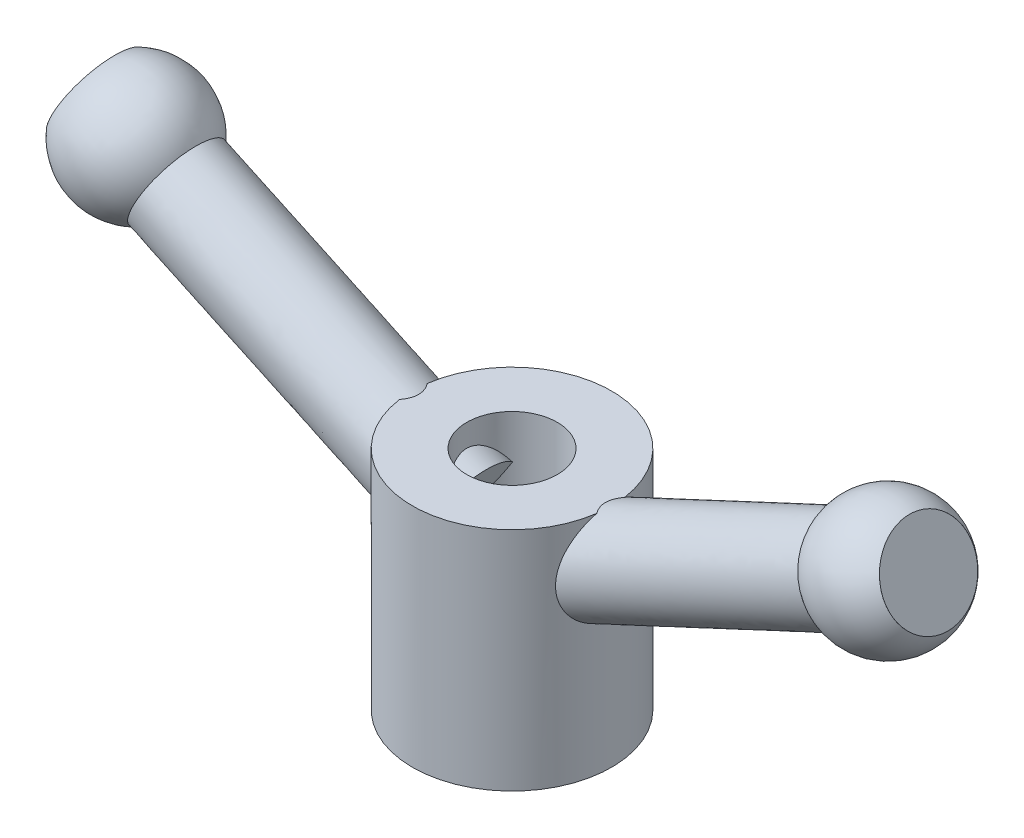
from build123d import *

# Parameters (mm, degrees)
SKETCH1_R      = 17.4625
SKETCH1_R_2    = 7.9375
EXTRUDE1_DEPTH = 39.6875
SKETCH4_R      = 7.9375
SKETCH6_R      = 7.9375


with BuildPart() as part:
    # Sketch1 → Extrude1 (new body)
    with BuildSketch(Plane(origin=(0, 0, 0), x_dir=(1, 0, 0), z_dir=(0, 1, 0))):
        with Locations(Location((0, 0, 0), (0, 0, 172.002086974))):
            Circle(SKETCH1_R)
        with Locations(Location((0, 0, 0), (0, 0, 270))):
            Circle(SKETCH1_R_2, mode=Mode.SUBTRACT)
    extrude(amount=EXTRUDE1_DEPTH)

    # Sweep1: sweep along a path in Sketch2
    with BuildLine(Plane.XY) as sweep1_path:
        Line((-7.9375, 26.9875), (-73.025, 57.3382997))
    # Sketch4 → Sweep1 (sweep)
    with BuildSketch(Plane(origin=(-16.89176645, 7.941461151, 0), x_dir=(0, 0, -1), z_dir=(0.9049756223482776, -0.4254634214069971, 0))):
        with Locations((0, 21.045913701)):
            Circle(SKETCH4_R)
    sweep(path=sweep1_path.line)

    # Sweep2: sweep along a path in Sketch2_3
    with BuildLine(Plane.XY) as sweep2_path:
        Line((7.9375, 26.9875), (73.025, 57.3382997))
    # Sketch6 → Sweep2 (sweep)
    with BuildSketch(Plane(origin=(16.89176645, 7.941461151, 0), x_dir=(0, 0, -1), z_dir=(0.9049756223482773, 0.4254634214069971, 0))):
        with Locations((0, 21.045913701)):
            Circle(SKETCH6_R)
    sweep(path=sweep2_path.line)


with BuildPart() as body_2:
    # Sketch7 → Revolve1 (revolve)
    with BuildSketch(Plane(origin=(-8.91912553, 19.127126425, 0), x_dir=(-0.9063069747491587, -0.42261788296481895, 0.0013388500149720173), z_dir=(-0.4226182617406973, 0.906307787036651, 0)), mode=Mode.PRIVATE) as revolve1_sk:
        with BuildLine():
            Line((-74.674348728, 8.037484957), (-90.404630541, 8.058545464))
            ThreePointArc((-90.404630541, 8.058545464), (-82.535122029, 11.310219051), (-74.674348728, 8.037484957))
        make_face()
    revolve(revolve1_sk.sketch.rotate(Axis((7.9375, 26.9875, 0), (0.906307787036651, 0.4226182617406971, 0)), 90), axis=Axis((7.9375, 26.9875, 0), (0.906307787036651, 0.4226182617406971, 0)))


with BuildPart() as body_3:
    # Sketch8 → Revolve2 (revolve)
    with BuildSketch(Plane(origin=(8.91912553, 19.127126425, 0), x_dir=(-0.906307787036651, 0.4226182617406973, 0), z_dir=(0.4226182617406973, 0.906307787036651, 0)), mode=Mode.PRIVATE) as revolve2_sk:
        with BuildLine():
            Line((74.684661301, -7.9375), (90.415338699, -7.9375))
            ThreePointArc((90.415338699, -7.9375), (82.55, -11.199897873), (74.684661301, -7.9375))
        make_face()
    revolve(revolve2_sk.sketch.rotate(Axis((-7.9375, 26.9875, 0), (-0.906307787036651, 0.4226182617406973, 0)), 270), axis=Axis((-7.9375, 26.9875, 0), (-0.906307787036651, 0.4226182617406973, 0)))


solid = Compound([part.part, body_2.part, body_3.part])
